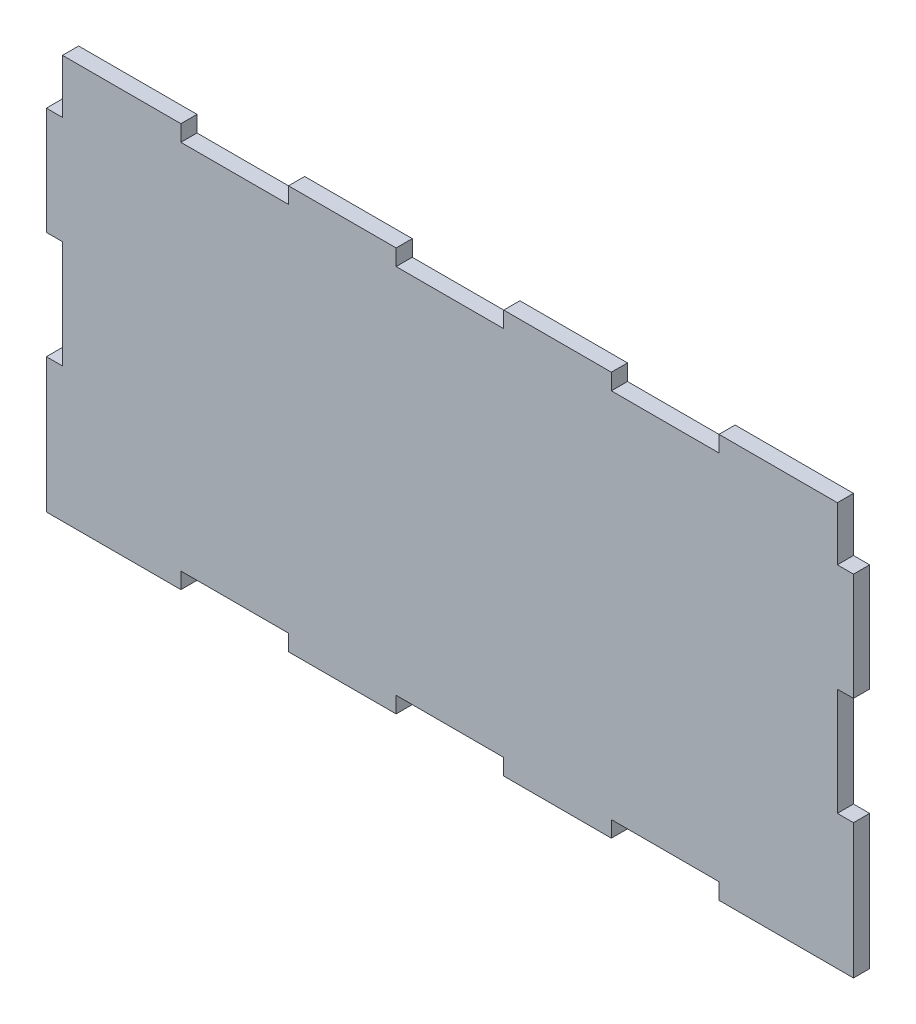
from build123d import *

# Parameters (mm, degrees)
SKETCH1_W           = 600
SKETCH1_H           = 300
BOSS_EXTRUDE1_DEPTH = 12
SKETCH2_W           = 80
SKETCH2_H           = 12
SKETCH2_W_2         = 12
SKETCH2_H_2         = 80
CUT_EXTRUDE1_DEPTH  = 12


with BuildPart() as part:
    # Sketch1 → Boss-Extrude1 (new body)
    with BuildSketch(Plane.XY):
        with Locations((300, 150)):
            Rectangle(SKETCH1_W, SKETCH1_H)
    extrude(amount=BOSS_EXTRUDE1_DEPTH)

    # Sketch2 → Cut-Extrude1 (cut)
    with BuildSketch(Plane.XY.offset(12)):
        with Locations((140, 6)):
            Rectangle(SKETCH2_W, SKETCH2_H)
        with Locations((300, 6)):
            Rectangle(SKETCH2_W, SKETCH2_H)
        with Locations((460, 6)):
            Rectangle(SKETCH2_W, SKETCH2_H)
        with Locations((6, 140)):
            Rectangle(SKETCH2_W_2, SKETCH2_H_2)
        with Locations((6, 300)):
            Rectangle(SKETCH2_W_2, SKETCH2_H_2)
        with Locations((460, 294)):
            Rectangle(SKETCH2_W, SKETCH2_H)
        with Locations((300, 294)):
            Rectangle(SKETCH2_W, SKETCH2_H)
        with Locations((140, 294)):
            Rectangle(SKETCH2_W, SKETCH2_H)
        with Locations((594, 300)):
            Rectangle(SKETCH2_W_2, SKETCH2_H_2)
        with Locations((594, 140)):
            Rectangle(SKETCH2_W_2, SKETCH2_H_2)
    extrude(amount=-CUT_EXTRUDE1_DEPTH, mode=Mode.SUBTRACT)


solid = part.part
